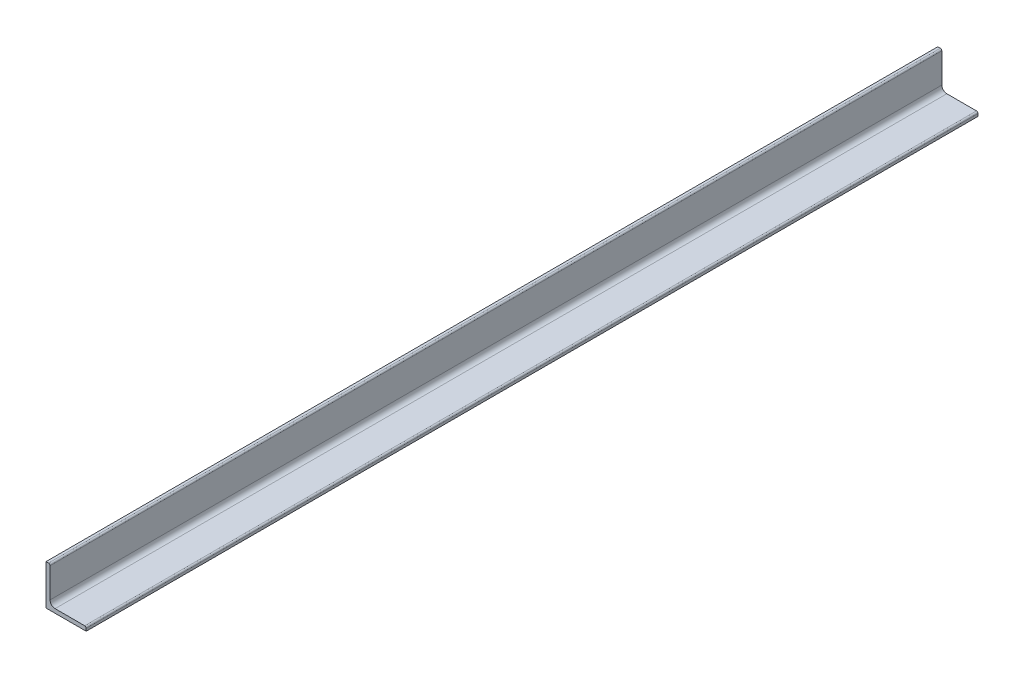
from build123d import *

# Parameters (mm, degrees)
EXTRUDE_1_DEPTH = 443.5


with BuildPart() as part:
    # Sketch 1 → Extrude 1 (new, symmetric)
    with BuildSketch(Plane.XY):
        with BuildLine():
            Line((0, 40), (0, 0))
            Line((0, 0), (40, 0))
            Line((40, 0), (40, 2.5))
            ThreePointArc((40, 2.5), (39.560660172, 3.560660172), (38.5, 4))
            Line((38.5, 4), (9, 4))
            ThreePointArc((9, 4), (5.464466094, 5.464466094), (4, 9))
            Line((4, 9), (4, 38.5))
            ThreePointArc((4, 38.5), (3.560660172, 39.560660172), (2.5, 40))
            Line((2.5, 40), (0, 40))
        make_face()
    extrude(amount=EXTRUDE_1_DEPTH, both=True)


solid = part.part
